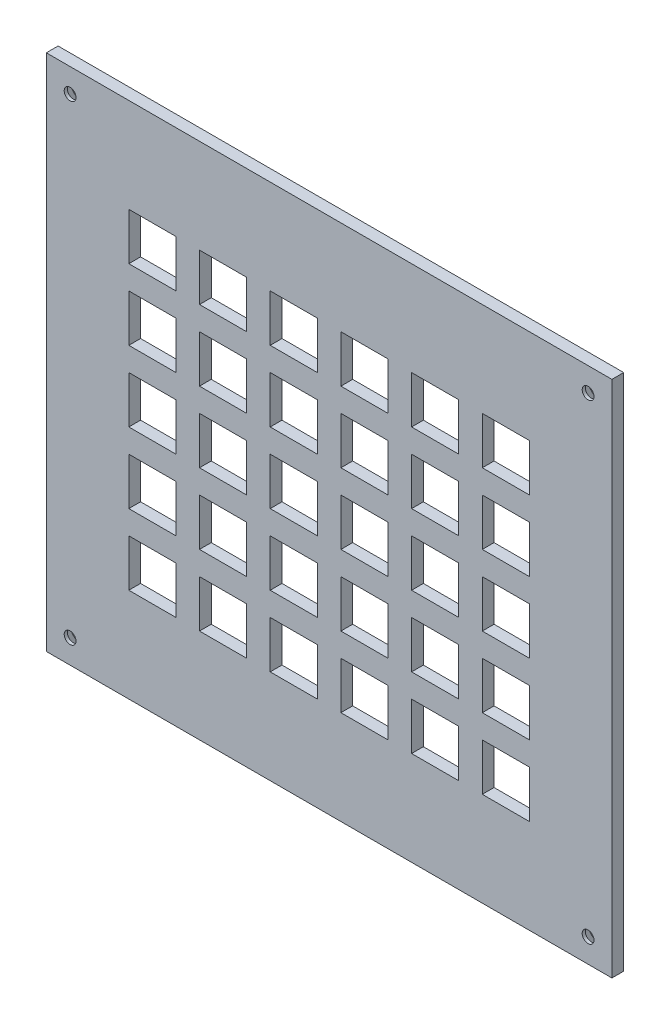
from build123d import *

# Parameters (mm, degrees)
SKETCH1_W           = 152.4
SKETCH1_H           = 139.7
BOSS_EXTRUDE1_DEPTH = 3.175
SKETCH3_W           = 12.7
SKETCH3_H           = 12.7
CUT_EXTRUDE1_DEPTH  = 104.419258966


with BuildPart() as part:
    # Sketch1 → Boss-Extrude1 (new body)
    with BuildSketch(Plane.XY):
        Rectangle(SKETCH1_W, SKETCH1_H)
    extrude(amount=BOSS_EXTRUDE1_DEPTH)

    # Sketch3 → Cut-Extrude1 (cut, through all)
    with BuildSketch(Plane.XY.offset(3.175)):
        with Locations((-47.625, -38.1)):
            Rectangle(SKETCH3_W, SKETCH3_H)
        with Locations((-28.575, -38.1)):
            Rectangle(SKETCH3_W, SKETCH3_H)
        with Locations((-9.525, -38.1)):
            Rectangle(SKETCH3_W, SKETCH3_H)
        with Locations((9.525, -38.1)):
            Rectangle(SKETCH3_W, SKETCH3_H)
        with Locations((28.575, -38.1)):
            Rectangle(SKETCH3_W, SKETCH3_H)
        with Locations((47.625, -38.1)):
            Rectangle(SKETCH3_W, SKETCH3_H)
        with Locations((-28.575, -19.05)):
            Rectangle(SKETCH3_W, SKETCH3_H)
        with Locations((-9.525, -19.05)):
            Rectangle(SKETCH3_W, SKETCH3_H)
        with Locations((9.525, -19.05)):
            Rectangle(SKETCH3_W, SKETCH3_H)
        with Locations((28.575, -19.05)):
            Rectangle(SKETCH3_W, SKETCH3_H)
        with Locations((47.625, -19.05)):
            Rectangle(SKETCH3_W, SKETCH3_H)
        with Locations((-28.575, 0)):
            Rectangle(SKETCH3_W, SKETCH3_H)
        with Locations((-9.525, 0)):
            Rectangle(SKETCH3_W, SKETCH3_H)
        with Locations((9.525, 0)):
            Rectangle(SKETCH3_W, SKETCH3_H)
        with Locations((28.575, 0)):
            Rectangle(SKETCH3_W, SKETCH3_H)
        with Locations((47.625, 0)):
            Rectangle(SKETCH3_W, SKETCH3_H)
        with Locations((-28.575, 19.05)):
            Rectangle(SKETCH3_W, SKETCH3_H)
        with Locations((-9.525, 19.05)):
            Rectangle(SKETCH3_W, SKETCH3_H)
        with Locations((9.525, 19.05)):
            Rectangle(SKETCH3_W, SKETCH3_H)
        with Locations((28.575, 19.05)):
            Rectangle(SKETCH3_W, SKETCH3_H)
        with Locations((47.625, 19.05)):
            Rectangle(SKETCH3_W, SKETCH3_H)
        with Locations((-28.575, 38.1)):
            Rectangle(SKETCH3_W, SKETCH3_H)
        with Locations((-9.525, 38.1)):
            Rectangle(SKETCH3_W, SKETCH3_H)
        with Locations((9.525, 38.1)):
            Rectangle(SKETCH3_W, SKETCH3_H)
        with Locations((28.575, 38.1)):
            Rectangle(SKETCH3_W, SKETCH3_H)
        with Locations((47.625, 38.1)):
            Rectangle(SKETCH3_W, SKETCH3_H)
        with Locations((-47.625, -19.05)):
            Rectangle(SKETCH3_W, SKETCH3_H)
        with Locations((-47.625, 0)):
            Rectangle(SKETCH3_W, SKETCH3_H)
        with Locations((-47.625, 19.05)):
            Rectangle(SKETCH3_W, SKETCH3_H)
        with Locations((-47.625, 38.1)):
            Rectangle(SKETCH3_W, SKETCH3_H)
    extrude(amount=-CUT_EXTRUDE1_DEPTH, mode=Mode.SUBTRACT)

    # Sketch5 → Cut-Revolve1 (revolve, cut)
    with BuildSketch(Plane(origin=(69.7865, 0, 0), x_dir=(0, 0, -1), z_dir=(1, 0, 0)), mode=Mode.PRIVATE) as cut_revolve1_sk:
        Polygon((0, 63.4365), (0, 66.64325), (-2.32918, 65.02654), (-3.175, 65.02654), (-3.175, 63.4365), align=None)
    cut_revolve1 = revolve(cut_revolve1_sk.sketch.rotate(Axis((69.7865, 63.4365, 0), (0, 0, 1)), 90), axis=Axis((69.7865, 63.4365, 0), (0, 0, 1)), mode=Mode.SUBTRACT)

    # Mirror1: Cut-Revolve1 across plane
    add(cut_revolve1.mirror(Plane(origin=(0, 0, 0), x_dir=(0, 0, 1), z_dir=(1, 0, 0))), mode=Mode.SUBTRACT)

    # Mirror2: Cut-Revolve1 across plane
    add(cut_revolve1.mirror(Plane.ZX), mode=Mode.SUBTRACT)

    # Mirror2 copy 1 sketch → Mirror2 copy 1 (revolve, cut)
    with BuildSketch(Plane(origin=(-69.7865, 0, 0), x_dir=(0, 0, -1), z_dir=(-1, 0, 0))):
        Polygon((0, 63.4365), (0, 66.64325), (-2.32918, 65.02654), (-3.175, 65.02654), (-3.175, 63.4365), align=None)
    revolve(axis=Axis((-69.7865, -63.4365, 0), (0, 0, 1)), mode=Mode.SUBTRACT)


solid = part.part
